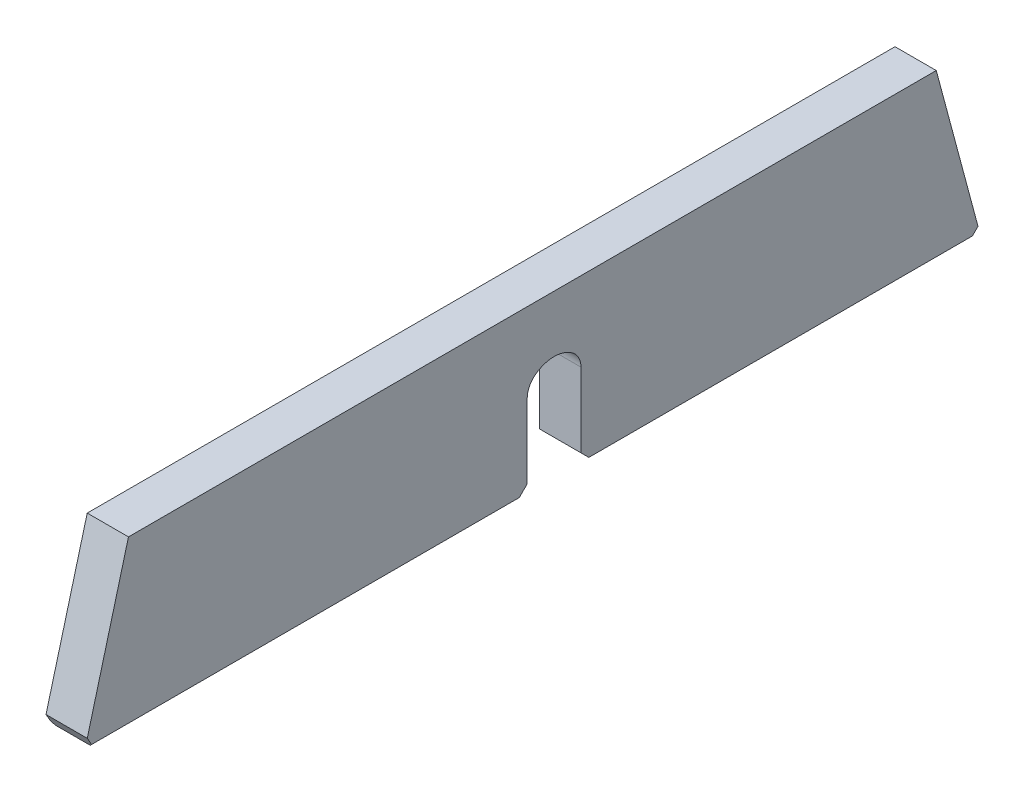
from build123d import *
from OCP.BRepFilletAPI import BRepFilletAPI_MakeChamfer

# Parameters (mm, degrees)
SKETCH2_W               = 810.995
SKETCH2_H               = 3979.45
BOSS_EXTRUDE1_DEPTH     = 101.6
CUT_EXTRUDE2_DEPTH      = 2034.16412474
CUT_EXTRUDE2_DEPTH_BACK = 2034.16412474
BOSS_EXTRUDE2_DEPTH     = 101.6
CHAMFER2_SIZE           = 16
CHAMFER3_SIZE           = 55
CHAMFER3_SIZE2          = 44.907311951


with BuildPart() as part:
    # Sketch2 → Boss-Extrude1 (new, symmetric)
    with BuildSketch(Plane.YZ):
        Rectangle(SKETCH2_W, SKETCH2_H)
    extrude(amount=BOSS_EXTRUDE1_DEPTH, both=True)

    # Sketch4 → Cut-Extrude2 (cut, two sides: drawn at the far end of the back side and taken through both)
    with BuildSketch(Plane.YZ.offset(-CUT_EXTRUDE2_DEPTH_BACK)):
        with BuildLine():
            Line((-717.599059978, 25.2765), (15.32465804, 25.2765))
            ThreePointArc((15.32465804, 25.2765), (58.953918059, 15.256984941), (93.840297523, -12.793746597))
            ThreePointArc((93.840297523, -12.793746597), (126.52376813, -107.0055), (93.840297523, -201.217253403))
            ThreePointArc((93.840297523, -201.217253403), (58.953918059, -229.267984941), (15.32465804, -239.2875))
            Line((15.32465804, -239.2875), (-717.599059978, -239.2875))
            Line((-717.599059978, -239.2875), (-717.599059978, 25.2765))
        make_face()
    extrude(amount=CUT_EXTRUDE2_DEPTH + CUT_EXTRUDE2_DEPTH_BACK, mode=Mode.SUBTRACT)

    # Sketch5 → Boss-Extrude2 (add, symmetric)
    with BuildSketch(Plane.YZ):
        Polygon((405.4975, 1989.725), (-405.4975, 2207.030455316), (-405.4975, 1989.725), align=None)
        Polygon((405.4975, -1989.725), (-405.4975, -2207.030455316), (-405.4975, -1989.725), align=None)
    extrude(amount=BOSS_EXTRUDE2_DEPTH, both=True)

    # Chamfer2
    chamfer2_edges = [part.edges().sort_by_distance(p)[0] for p in [
        (101.6, -405.4975, 1116.153477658),
        (-101.6, -405.4975, -1223.158977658),
        (101.6, -405.4975, -1223.158977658),
        (-101.6, -405.4975, 1116.153477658),
    ]]
    chamfer(chamfer2_edges, length=CHAMFER2_SIZE)

    # Chamfer3: one chamfer whose edges measure the first distance from different faces: ONE call of the kernel's chamfer builder (chamfer() names one face for all edges)
    chamfer3_edges_1 = [part.edges().sort_by_distance(p)[0] for p in [
        (0, -405.4975, -2207.030455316),
    ]]
    chamfer3_side_1 = [part.faces().sort_by_distance(p)[0] for p in [
        (0, -405.4975, -1223.158977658),
    ]]
    chamfer3_edges_2 = [part.edges().sort_by_distance(p)[0] for p in [
        (0, -405.4975, -239.2875),
        (0, -405.4975, 25.2765),
    ]]
    chamfer3_edges_3 = [part.edges().sort_by_distance(p)[0] for p in [
        (0, -405.4975, 2207.030455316),
    ]]
    chamfer3_side_3 = [part.faces().sort_by_distance(p)[0] for p in [
        (0, 0.622603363, 2098.21090159),
    ]]
    chamfer3 = BRepFilletAPI_MakeChamfer(part.part.solid().wrapped)
    for e in chamfer3_edges_1:
        chamfer3.Add(CHAMFER3_SIZE, CHAMFER3_SIZE2, e.wrapped, chamfer3_side_1[0].wrapped)  # the first distance lies on this face
    for e in chamfer3_edges_2:
        chamfer3.Add(CHAMFER3_SIZE, e.wrapped)
    for e in chamfer3_edges_3:
        chamfer3.Add(CHAMFER3_SIZE, CHAMFER3_SIZE2, e.wrapped, chamfer3_side_3[0].wrapped)  # the first distance lies on this face
    add(Compound.cast(chamfer3.Shape()), mode=Mode.REPLACE)


solid = part.part
